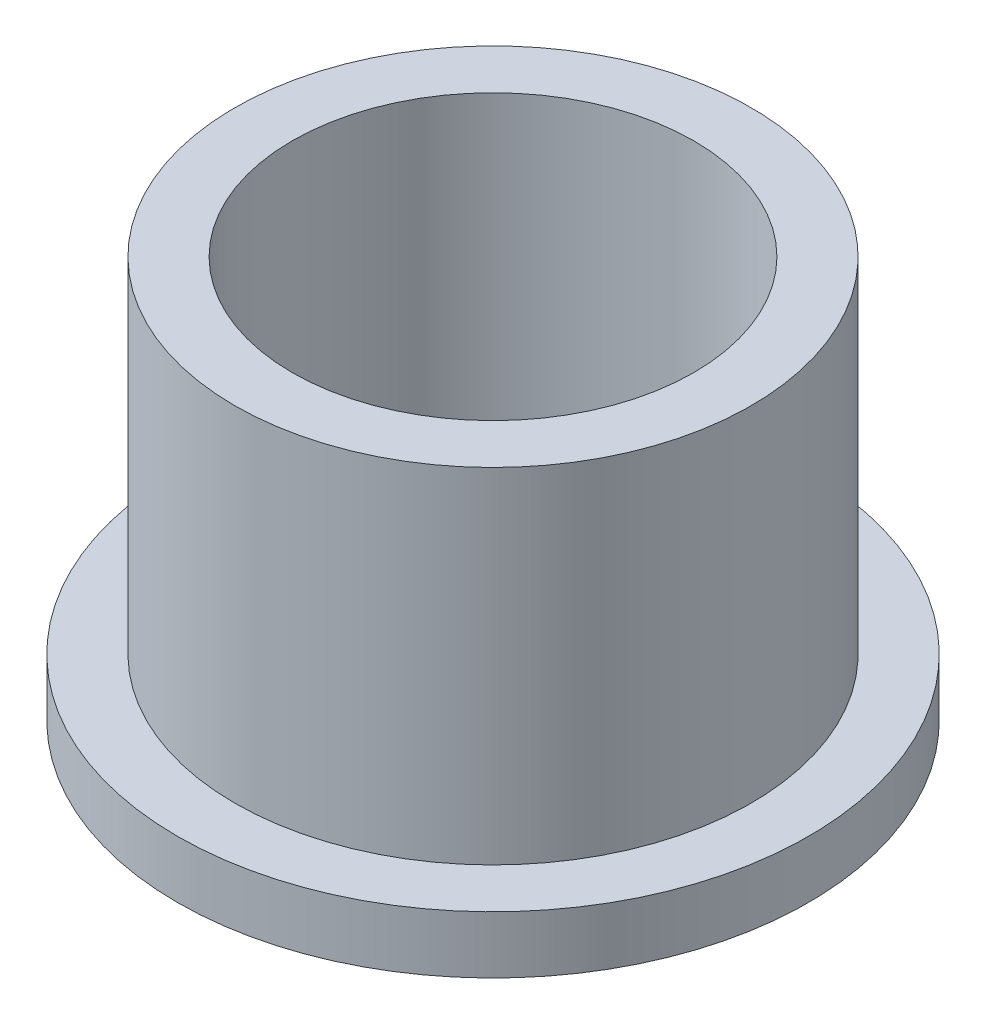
ISO-10303-21;
HEADER;
FILE_DESCRIPTION(('STEP AP214'),'2;1');
FILE_NAME('part.step','',(''),(''),'','','');
FILE_SCHEMA(('AUTOMOTIVE_DESIGN { 1 0 10303 214 1 1 1 1 }'));
ENDSEC;
DATA;
#1=APPLICATION_CONTEXT('core data for automotive mechanical design processes');
#2=APPLICATION_PROTOCOL_DEFINITION('international standard','automotive_design',2000,#1);
#3=PRODUCT_CONTEXT('',#1,'mechanical');
#4=PRODUCT('Part','Part','',(#3));
#5=PRODUCT_RELATED_PRODUCT_CATEGORY('part','',(#4));
#6=PRODUCT_DEFINITION_FORMATION('','',#4);
#7=PRODUCT_DEFINITION_CONTEXT('part definition',#1,'design');
#8=PRODUCT_DEFINITION('design','',#6,#7);
#9=PRODUCT_DEFINITION_SHAPE('','',#8);
#10=(LENGTH_UNIT() NAMED_UNIT(*) SI_UNIT(.MILLI.,.METRE.));
#11=(NAMED_UNIT(*) PLANE_ANGLE_UNIT() SI_UNIT($,.RADIAN.));
#12=(NAMED_UNIT(*) SI_UNIT($,.STERADIAN.) SOLID_ANGLE_UNIT());
#13=UNCERTAINTY_MEASURE_WITH_UNIT(LENGTH_MEASURE(1.E-05),#10,'distance_accuracy_value','');
#14=(GEOMETRIC_REPRESENTATION_CONTEXT(3) GLOBAL_UNCERTAINTY_ASSIGNED_CONTEXT((#13)) GLOBAL_UNIT_ASSIGNED_CONTEXT((#10,
#11,#12)) REPRESENTATION_CONTEXT('',''));
#15=CARTESIAN_POINT('',(0.,0.,0.));
#16=DIRECTION('',(0.,0.,1.));
#17=DIRECTION('',(1.,0.,0.));
#18=AXIS2_PLACEMENT_3D('',#15,#16,#17);
#19=CARTESIAN_POINT('',(0.,14.,0.));
#20=DIRECTION('',(0.,1.,0.));
#21=DIRECTION('',(0.,0.,1.));
#22=AXIS2_PLACEMENT_3D('',#19,#20,#21);
#23=PLANE('',#22);
#24=CARTESIAN_POINT('',(0.,14.,0.));
#25=DIRECTION('',(0.,1.,0.));
#26=DIRECTION('',(0.,0.,1.));
#27=AXIS2_PLACEMENT_3D('',#24,#25,#26);
#28=CIRCLE('',#27,9.);
#29=CARTESIAN_POINT('',(0.,14.,9.));
#30=VERTEX_POINT('',#29);
#31=EDGE_CURVE('E10',#30,#30,#28,.T.);
#32=ORIENTED_EDGE('',*,*,#31,.T.);
#33=EDGE_LOOP('',(#32));
#34=FACE_BOUND('',#33,.T.);
#35=CARTESIAN_POINT('',(0.,14.,0.));
#36=DIRECTION('',(0.,1.,0.));
#37=DIRECTION('',(0.,0.,1.));
#38=AXIS2_PLACEMENT_3D('',#35,#36,#37);
#39=CIRCLE('',#38,7.);
#40=CARTESIAN_POINT('',(0.,14.,7.));
#41=VERTEX_POINT('',#40);
#42=EDGE_CURVE('E40',#41,#41,#39,.T.);
#43=ORIENTED_EDGE('',*,*,#42,.F.);
#44=EDGE_LOOP('',(#43));
#45=FACE_BOUND('',#44,.T.);
#46=ADVANCED_FACE('F33',(#34,#45),#23,.T.);
#47=CARTESIAN_POINT('',(0.,0.,0.));
#48=DIRECTION('',(0.,1.,0.));
#49=DIRECTION('',(0.,0.,1.));
#50=AXIS2_PLACEMENT_3D('',#47,#48,#49);
#51=PLANE('',#50);
#52=CARTESIAN_POINT('',(0.,0.,0.));
#53=DIRECTION('',(0.,1.,0.));
#54=DIRECTION('',(0.,0.,1.));
#55=AXIS2_PLACEMENT_3D('',#52,#53,#54);
#56=CIRCLE('',#55,7.);
#57=CARTESIAN_POINT('',(0.,0.,7.));
#58=VERTEX_POINT('',#57);
#59=EDGE_CURVE('E44',#58,#58,#56,.T.);
#60=ORIENTED_EDGE('',*,*,#59,.T.);
#61=EDGE_LOOP('',(#60));
#62=FACE_BOUND('',#61,.T.);
#63=CARTESIAN_POINT('',(0.,0.,0.));
#64=DIRECTION('',(0.,1.,0.));
#65=DIRECTION('',(0.,0.,1.));
#66=AXIS2_PLACEMENT_3D('',#63,#64,#65);
#67=CIRCLE('',#66,11.);
#68=CARTESIAN_POINT('',(0.,0.,11.));
#69=VERTEX_POINT('',#68);
#70=EDGE_CURVE('E51',#69,#69,#67,.T.);
#71=ORIENTED_EDGE('',*,*,#70,.F.);
#72=EDGE_LOOP('',(#71));
#73=FACE_BOUND('',#72,.T.);
#74=ADVANCED_FACE('F76',(#62,#73),#51,.F.);
#75=CARTESIAN_POINT('',(0.,14.,0.));
#76=DIRECTION('',(0.,-1.,0.));
#77=DIRECTION('',(0.,0.,-1.));
#78=AXIS2_PLACEMENT_3D('',#75,#76,#77);
#79=CYLINDRICAL_SURFACE('',#78,9.);
#80=CARTESIAN_POINT('',(0.,2.,0.));
#81=DIRECTION('',(0.,1.,0.));
#82=DIRECTION('',(0.,0.,1.));
#83=AXIS2_PLACEMENT_3D('',#80,#81,#82);
#84=CIRCLE('',#83,9.);
#85=CARTESIAN_POINT('',(0.,2.,9.));
#86=VERTEX_POINT('',#85);
#87=EDGE_CURVE('E54',#86,#86,#84,.T.);
#88=ORIENTED_EDGE('',*,*,#87,.T.);
#89=EDGE_LOOP('',(#88));
#90=FACE_BOUND('',#89,.T.);
#91=ORIENTED_EDGE('',*,*,#31,.F.);
#92=EDGE_LOOP('',(#91));
#93=FACE_BOUND('',#92,.T.);
#94=ADVANCED_FACE('F35',(#90,#93),#79,.T.);
#95=CARTESIAN_POINT('',(0.,14.,0.));
#96=DIRECTION('',(0.,-1.,0.));
#97=DIRECTION('',(0.,0.,-1.));
#98=AXIS2_PLACEMENT_3D('',#95,#96,#97);
#99=CYLINDRICAL_SURFACE('',#98,7.);
#100=ORIENTED_EDGE('',*,*,#42,.T.);
#101=EDGE_LOOP('',(#100));
#102=FACE_BOUND('',#101,.T.);
#103=ORIENTED_EDGE('',*,*,#59,.F.);
#104=EDGE_LOOP('',(#103));
#105=FACE_BOUND('',#104,.T.);
#106=ADVANCED_FACE('F65',(#102,#105),#99,.F.);
#107=CARTESIAN_POINT('',(0.,2.,0.));
#108=DIRECTION('',(0.,1.,0.));
#109=DIRECTION('',(0.,0.,1.));
#110=AXIS2_PLACEMENT_3D('',#107,#108,#109);
#111=PLANE('',#110);
#112=CARTESIAN_POINT('',(0.,2.,0.));
#113=DIRECTION('',(0.,1.,0.));
#114=DIRECTION('',(0.,0.,1.));
#115=AXIS2_PLACEMENT_3D('',#112,#113,#114);
#116=CIRCLE('',#115,11.);
#117=CARTESIAN_POINT('',(0.,2.,11.));
#118=VERTEX_POINT('',#117);
#119=EDGE_CURVE('E49',#118,#118,#116,.T.);
#120=ORIENTED_EDGE('',*,*,#119,.T.);
#121=EDGE_LOOP('',(#120));
#122=FACE_BOUND('',#121,.T.);
#123=ORIENTED_EDGE('',*,*,#87,.F.);
#124=EDGE_LOOP('',(#123));
#125=FACE_BOUND('',#124,.T.);
#126=ADVANCED_FACE('F62',(#122,#125),#111,.T.);
#127=CARTESIAN_POINT('',(0.,2.,0.));
#128=DIRECTION('',(0.,-1.,0.));
#129=DIRECTION('',(0.,0.,-1.));
#130=AXIS2_PLACEMENT_3D('',#127,#128,#129);
#131=CYLINDRICAL_SURFACE('',#130,11.);
#132=ORIENTED_EDGE('',*,*,#119,.F.);
#133=EDGE_LOOP('',(#132));
#134=FACE_BOUND('',#133,.T.);
#135=ORIENTED_EDGE('',*,*,#70,.T.);
#136=EDGE_LOOP('',(#135));
#137=FACE_BOUND('',#136,.T.);
#138=ADVANCED_FACE('F64',(#134,#137),#131,.T.);
#139=CLOSED_SHELL('',(#46,#74,#94,#106,#126,#138));
#140=MANIFOLD_SOLID_BREP('B2',#139);
#141=ADVANCED_BREP_SHAPE_REPRESENTATION('',(#18,#140),#14);
#142=SHAPE_DEFINITION_REPRESENTATION(#9,#141);
ENDSEC;
END-ISO-10303-21;
